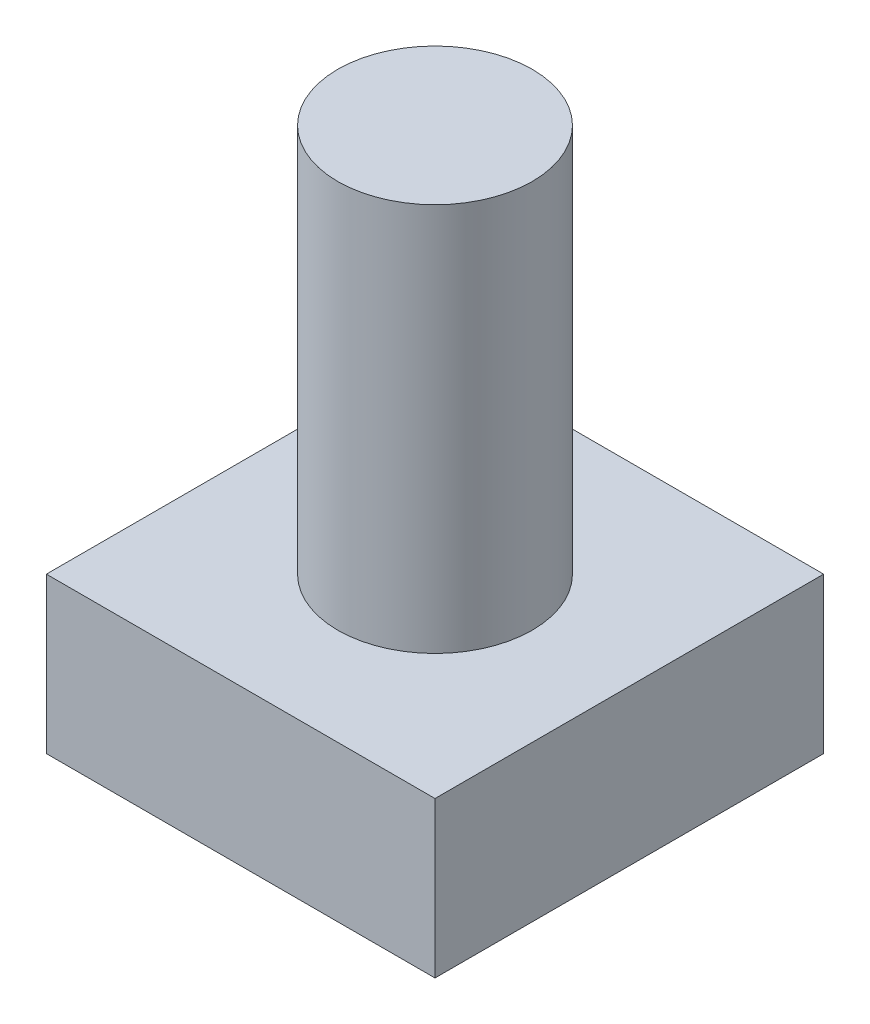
ISO-10303-21;
HEADER;
FILE_DESCRIPTION(('STEP AP214'),'2;1');
FILE_NAME('part.step','',(''),(''),'','','');
FILE_SCHEMA(('AUTOMOTIVE_DESIGN { 1 0 10303 214 1 1 1 1 }'));
ENDSEC;
DATA;
#1=APPLICATION_CONTEXT('core data for automotive mechanical design processes');
#2=APPLICATION_PROTOCOL_DEFINITION('international standard','automotive_design',2000,#1);
#3=PRODUCT_CONTEXT('',#1,'mechanical');
#4=PRODUCT('Part','Part','',(#3));
#5=PRODUCT_RELATED_PRODUCT_CATEGORY('part','',(#4));
#6=PRODUCT_DEFINITION_FORMATION('','',#4);
#7=PRODUCT_DEFINITION_CONTEXT('part definition',#1,'design');
#8=PRODUCT_DEFINITION('design','',#6,#7);
#9=PRODUCT_DEFINITION_SHAPE('','',#8);
#10=(LENGTH_UNIT() NAMED_UNIT(*) SI_UNIT(.MILLI.,.METRE.));
#11=(NAMED_UNIT(*) PLANE_ANGLE_UNIT() SI_UNIT($,.RADIAN.));
#12=(NAMED_UNIT(*) SI_UNIT($,.STERADIAN.) SOLID_ANGLE_UNIT());
#13=UNCERTAINTY_MEASURE_WITH_UNIT(LENGTH_MEASURE(1.E-05),#10,'distance_accuracy_value','');
#14=(GEOMETRIC_REPRESENTATION_CONTEXT(3) GLOBAL_UNCERTAINTY_ASSIGNED_CONTEXT((#13)) GLOBAL_UNIT_ASSIGNED_CONTEXT((#10,
#11,#12)) REPRESENTATION_CONTEXT('',''));
#15=CARTESIAN_POINT('',(0.,0.,0.));
#16=DIRECTION('',(0.,0.,1.));
#17=DIRECTION('',(1.,0.,0.));
#18=AXIS2_PLACEMENT_3D('',#15,#16,#17);
#19=CARTESIAN_POINT('',(0.,200.,0.));
#20=DIRECTION('',(0.,1.,0.));
#21=DIRECTION('',(0.,0.,1.));
#22=AXIS2_PLACEMENT_3D('',#19,#20,#21);
#23=PLANE('',#22);
#24=CARTESIAN_POINT('',(1.11022302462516E-13,200.,0.));
#25=DIRECTION('',(0.,1.,0.));
#26=DIRECTION('',(0.,0.,1.));
#27=AXIS2_PLACEMENT_3D('',#24,#25,#26);
#28=CIRCLE('',#27,125.079845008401);
#29=CARTESIAN_POINT('',(1.11022302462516E-13,200.,125.079845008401));
#30=VERTEX_POINT('',#29);
#31=EDGE_CURVE('E128',#30,#30,#28,.T.);
#32=ORIENTED_EDGE('',*,*,#31,.F.);
#33=EDGE_LOOP('',(#32));
#34=FACE_BOUND('',#33,.T.);
#35=DIRECTION('',(0.,0.,1.));
#36=VECTOR('',#35,1.);
#37=CARTESIAN_POINT('',(-250.,200.,250.));
#38=LINE('',#37,#36);
#39=CARTESIAN_POINT('',(-250.,200.,-250.));
#40=VERTEX_POINT('',#39);
#41=CARTESIAN_POINT('',(-250.,200.,250.));
#42=VERTEX_POINT('',#41);
#43=EDGE_CURVE('E90',#40,#42,#38,.T.);
#44=ORIENTED_EDGE('',*,*,#43,.T.);
#45=DIRECTION('',(1.,0.,0.));
#46=VECTOR('',#45,1.);
#47=CARTESIAN_POINT('',(250.,200.,250.));
#48=LINE('',#47,#46);
#49=CARTESIAN_POINT('',(250.,200.,250.));
#50=VERTEX_POINT('',#49);
#51=EDGE_CURVE('E86',#42,#50,#48,.T.);
#52=ORIENTED_EDGE('',*,*,#51,.T.);
#53=DIRECTION('',(0.,0.,-1.));
#54=VECTOR('',#53,1.);
#55=CARTESIAN_POINT('',(250.,200.,250.));
#56=LINE('',#55,#54);
#57=CARTESIAN_POINT('',(250.,200.,-250.));
#58=VERTEX_POINT('',#57);
#59=EDGE_CURVE('E88',#50,#58,#56,.T.);
#60=ORIENTED_EDGE('',*,*,#59,.T.);
#61=DIRECTION('',(-1.,0.,0.));
#62=VECTOR('',#61,1.);
#63=CARTESIAN_POINT('',(250.,200.,-250.));
#64=LINE('',#63,#62);
#65=EDGE_CURVE('E56',#58,#40,#64,.T.);
#66=ORIENTED_EDGE('',*,*,#65,.T.);
#67=EDGE_LOOP('',(#44,#52,#60,#66));
#68=FACE_BOUND('',#67,.T.);
#69=ADVANCED_FACE('F39',(#34,#68),#23,.T.);
#70=CARTESIAN_POINT('',(0.,0.,0.));
#71=DIRECTION('',(0.,1.,0.));
#72=DIRECTION('',(0.,0.,1.));
#73=AXIS2_PLACEMENT_3D('',#70,#71,#72);
#74=PLANE('',#73);
#75=DIRECTION('',(0.,0.,1.));
#76=VECTOR('',#75,1.);
#77=CARTESIAN_POINT('',(-250.,0.,250.));
#78=LINE('',#77,#76);
#79=CARTESIAN_POINT('',(-250.,0.,-250.));
#80=VERTEX_POINT('',#79);
#81=CARTESIAN_POINT('',(-250.,0.,250.));
#82=VERTEX_POINT('',#81);
#83=EDGE_CURVE('E107',#80,#82,#78,.T.);
#84=ORIENTED_EDGE('',*,*,#83,.F.);
#85=DIRECTION('',(-1.,0.,0.));
#86=VECTOR('',#85,1.);
#87=CARTESIAN_POINT('',(250.,0.,-250.));
#88=LINE('',#87,#86);
#89=CARTESIAN_POINT('',(250.,0.,-250.));
#90=VERTEX_POINT('',#89);
#91=EDGE_CURVE('E79',#90,#80,#88,.T.);
#92=ORIENTED_EDGE('',*,*,#91,.F.);
#93=DIRECTION('',(0.,0.,-1.));
#94=VECTOR('',#93,1.);
#95=CARTESIAN_POINT('',(250.,0.,250.));
#96=LINE('',#95,#94);
#97=CARTESIAN_POINT('',(250.,0.,250.));
#98=VERTEX_POINT('',#97);
#99=EDGE_CURVE('E73',#98,#90,#96,.T.);
#100=ORIENTED_EDGE('',*,*,#99,.F.);
#101=DIRECTION('',(1.,0.,0.));
#102=VECTOR('',#101,1.);
#103=CARTESIAN_POINT('',(250.,0.,250.));
#104=LINE('',#103,#102);
#105=EDGE_CURVE('E94',#82,#98,#104,.T.);
#106=ORIENTED_EDGE('',*,*,#105,.F.);
#107=EDGE_LOOP('',(#84,#92,#100,#106));
#108=FACE_BOUND('',#107,.T.);
#109=CARTESIAN_POINT('',(1.11022302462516E-13,0.,0.));
#110=DIRECTION('',(0.,1.,0.));
#111=DIRECTION('',(0.,0.,1.));
#112=AXIS2_PLACEMENT_3D('',#109,#110,#111);
#113=CIRCLE('',#112,100.);
#114=CARTESIAN_POINT('',(1.11022302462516E-13,0.,100.));
#115=VERTEX_POINT('',#114);
#116=EDGE_CURVE('E110',#115,#115,#113,.T.);
#117=ORIENTED_EDGE('',*,*,#116,.T.);
#118=EDGE_LOOP('',(#117));
#119=FACE_BOUND('',#118,.T.);
#120=ADVANCED_FACE('F118',(#108,#119),#74,.F.);
#121=CARTESIAN_POINT('',(-250.,200.,250.));
#122=DIRECTION('',(1.,0.,0.));
#123=DIRECTION('',(0.,0.,-1.));
#124=AXIS2_PLACEMENT_3D('',#121,#122,#123);
#125=PLANE('',#124);
#126=ORIENTED_EDGE('',*,*,#83,.T.);
#127=DIRECTION('',(0.,-1.,0.));
#128=VECTOR('',#127,1.);
#129=CARTESIAN_POINT('',(-250.,200.,250.));
#130=LINE('',#129,#128);
#131=EDGE_CURVE('E12',#42,#82,#130,.T.);
#132=ORIENTED_EDGE('',*,*,#131,.F.);
#133=ORIENTED_EDGE('',*,*,#43,.F.);
#134=DIRECTION('',(0.,-1.,0.));
#135=VECTOR('',#134,1.);
#136=CARTESIAN_POINT('',(-250.,200.,-250.));
#137=LINE('',#136,#135);
#138=EDGE_CURVE('E102',#40,#80,#137,.T.);
#139=ORIENTED_EDGE('',*,*,#138,.T.);
#140=EDGE_LOOP('',(#126,#132,#133,#139));
#141=FACE_BOUND('',#140,.T.);
#142=ADVANCED_FACE('F41',(#141),#125,.F.);
#143=CARTESIAN_POINT('',(250.,200.,250.));
#144=DIRECTION('',(0.,0.,-1.));
#145=DIRECTION('',(-1.,0.,0.));
#146=AXIS2_PLACEMENT_3D('',#143,#144,#145);
#147=PLANE('',#146);
#148=ORIENTED_EDGE('',*,*,#105,.T.);
#149=DIRECTION('',(0.,-1.,0.));
#150=VECTOR('',#149,1.);
#151=CARTESIAN_POINT('',(250.,200.,250.));
#152=LINE('',#151,#150);
#153=EDGE_CURVE('E48',#50,#98,#152,.T.);
#154=ORIENTED_EDGE('',*,*,#153,.F.);
#155=ORIENTED_EDGE('',*,*,#51,.F.);
#156=ORIENTED_EDGE('',*,*,#131,.T.);
#157=EDGE_LOOP('',(#148,#154,#155,#156));
#158=FACE_BOUND('',#157,.T.);
#159=ADVANCED_FACE('F93',(#158),#147,.F.);
#160=CARTESIAN_POINT('',(250.,200.,250.));
#161=DIRECTION('',(-1.,0.,0.));
#162=DIRECTION('',(0.,0.,1.));
#163=AXIS2_PLACEMENT_3D('',#160,#161,#162);
#164=PLANE('',#163);
#165=ORIENTED_EDGE('',*,*,#99,.T.);
#166=DIRECTION('',(0.,-1.,0.));
#167=VECTOR('',#166,1.);
#168=CARTESIAN_POINT('',(250.,200.,-250.));
#169=LINE('',#168,#167);
#170=EDGE_CURVE('E95',#58,#90,#169,.T.);
#171=ORIENTED_EDGE('',*,*,#170,.F.);
#172=ORIENTED_EDGE('',*,*,#59,.F.);
#173=ORIENTED_EDGE('',*,*,#153,.T.);
#174=EDGE_LOOP('',(#165,#171,#172,#173));
#175=FACE_BOUND('',#174,.T.);
#176=ADVANCED_FACE('F96',(#175),#164,.F.);
#177=CARTESIAN_POINT('',(250.,200.,-250.));
#178=DIRECTION('',(0.,0.,1.));
#179=DIRECTION('',(1.,0.,0.));
#180=AXIS2_PLACEMENT_3D('',#177,#178,#179);
#181=PLANE('',#180);
#182=ORIENTED_EDGE('',*,*,#91,.T.);
#183=ORIENTED_EDGE('',*,*,#138,.F.);
#184=ORIENTED_EDGE('',*,*,#65,.F.);
#185=ORIENTED_EDGE('',*,*,#170,.T.);
#186=EDGE_LOOP('',(#182,#183,#184,#185));
#187=FACE_BOUND('',#186,.T.);
#188=ADVANCED_FACE('F115',(#187),#181,.F.);
#189=CARTESIAN_POINT('',(1.11022302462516E-13,200.,0.));
#190=DIRECTION('',(0.,-1.,0.));
#191=DIRECTION('',(0.,0.,-1.));
#192=AXIS2_PLACEMENT_3D('',#189,#190,#191);
#193=CYLINDRICAL_SURFACE('',#192,100.);
#194=CARTESIAN_POINT('',(1.11022302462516E-13,200.,0.));
#195=DIRECTION('',(0.,1.,0.));
#196=DIRECTION('',(0.,0.,1.));
#197=AXIS2_PLACEMENT_3D('',#194,#195,#196);
#198=CIRCLE('',#197,100.);
#199=CARTESIAN_POINT('',(1.11022302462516E-13,200.,100.));
#200=VERTEX_POINT('',#199);
#201=EDGE_CURVE('E124',#200,#200,#198,.T.);
#202=ORIENTED_EDGE('',*,*,#201,.T.);
#203=EDGE_LOOP('',(#202));
#204=FACE_BOUND('',#203,.T.);
#205=ORIENTED_EDGE('',*,*,#116,.F.);
#206=EDGE_LOOP('',(#205));
#207=FACE_BOUND('',#206,.T.);
#208=ADVANCED_FACE('F151',(#204,#207),#193,.F.);
#209=CARTESIAN_POINT('',(1.11022302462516E-13,200.,0.));
#210=DIRECTION('',(0.,1.,0.));
#211=DIRECTION('',(0.,0.,1.));
#212=AXIS2_PLACEMENT_3D('',#209,#210,#211);
#213=PLANE('',#212);
#214=ORIENTED_EDGE('',*,*,#201,.F.);
#215=EDGE_LOOP('',(#214));
#216=FACE_BOUND('',#215,.T.);
#217=ADVANCED_FACE('F140',(#216),#213,.F.);
#218=CARTESIAN_POINT('',(1.11022302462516E-13,700.,0.));
#219=DIRECTION('',(0.,-1.,0.));
#220=DIRECTION('',(0.,0.,-1.));
#221=AXIS2_PLACEMENT_3D('',#218,#219,#220);
#222=CYLINDRICAL_SURFACE('',#221,125.079845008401);
#223=CARTESIAN_POINT('',(1.11022302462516E-13,700.,0.));
#224=DIRECTION('',(0.,1.,0.));
#225=DIRECTION('',(0.,0.,1.));
#226=AXIS2_PLACEMENT_3D('',#223,#224,#225);
#227=CIRCLE('',#226,125.079845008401);
#228=CARTESIAN_POINT('',(1.11022302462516E-13,700.,125.079845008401));
#229=VERTEX_POINT('',#228);
#230=EDGE_CURVE('E127',#229,#229,#227,.T.);
#231=ORIENTED_EDGE('',*,*,#230,.F.);
#232=EDGE_LOOP('',(#231));
#233=FACE_BOUND('',#232,.T.);
#234=ORIENTED_EDGE('',*,*,#31,.T.);
#235=EDGE_LOOP('',(#234));
#236=FACE_BOUND('',#235,.T.);
#237=ADVANCED_FACE('F137',(#233,#236),#222,.T.);
#238=CARTESIAN_POINT('',(1.11022302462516E-13,700.,0.));
#239=DIRECTION('',(0.,1.,0.));
#240=DIRECTION('',(0.,0.,1.));
#241=AXIS2_PLACEMENT_3D('',#238,#239,#240);
#242=PLANE('',#241);
#243=ORIENTED_EDGE('',*,*,#230,.T.);
#244=EDGE_LOOP('',(#243));
#245=FACE_BOUND('',#244,.T.);
#246=ADVANCED_FACE('F135',(#245),#242,.T.);
#247=CLOSED_SHELL('',(#69,#120,#142,#159,#176,#188,#208,#217,#237,#246));
#248=MANIFOLD_SOLID_BREP('B2',#247);
#249=ADVANCED_BREP_SHAPE_REPRESENTATION('',(#18,#248),#14);
#250=SHAPE_DEFINITION_REPRESENTATION(#9,#249);
ENDSEC;
END-ISO-10303-21;
